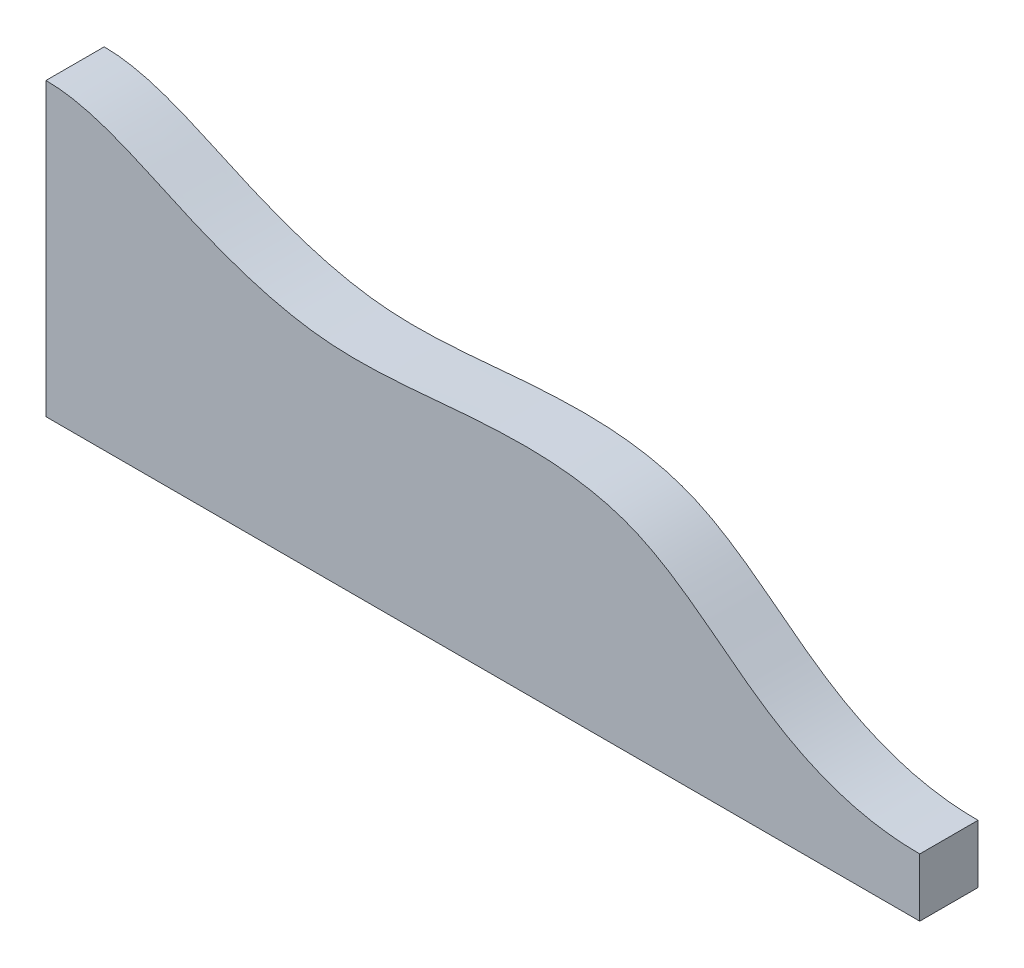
ISO-10303-21;
HEADER;
FILE_DESCRIPTION(('STEP AP214'),'2;1');
FILE_NAME('part.step','',(''),(''),'','','');
FILE_SCHEMA(('AUTOMOTIVE_DESIGN { 1 0 10303 214 1 1 1 1 }'));
ENDSEC;
DATA;
#1=APPLICATION_CONTEXT('core data for automotive mechanical design processes');
#2=APPLICATION_PROTOCOL_DEFINITION('international standard','automotive_design',2000,#1);
#3=PRODUCT_CONTEXT('',#1,'mechanical');
#4=PRODUCT('Part','Part','',(#3));
#5=PRODUCT_RELATED_PRODUCT_CATEGORY('part','',(#4));
#6=PRODUCT_DEFINITION_FORMATION('','',#4);
#7=PRODUCT_DEFINITION_CONTEXT('part definition',#1,'design');
#8=PRODUCT_DEFINITION('design','',#6,#7);
#9=PRODUCT_DEFINITION_SHAPE('','',#8);
#10=(LENGTH_UNIT() NAMED_UNIT(*) SI_UNIT(.MILLI.,.METRE.));
#11=(NAMED_UNIT(*) PLANE_ANGLE_UNIT() SI_UNIT($,.RADIAN.));
#12=(NAMED_UNIT(*) SI_UNIT($,.STERADIAN.) SOLID_ANGLE_UNIT());
#13=UNCERTAINTY_MEASURE_WITH_UNIT(LENGTH_MEASURE(1.E-05),#10,'distance_accuracy_value','');
#14=(GEOMETRIC_REPRESENTATION_CONTEXT(3) GLOBAL_UNCERTAINTY_ASSIGNED_CONTEXT((#13)) GLOBAL_UNIT_ASSIGNED_CONTEXT((#10,
#11,#12)) REPRESENTATION_CONTEXT('',''));
#15=CARTESIAN_POINT('',(0.,0.,0.));
#16=DIRECTION('',(0.,0.,1.));
#17=DIRECTION('',(1.,0.,0.));
#18=AXIS2_PLACEMENT_3D('',#15,#16,#17);
#19=CARTESIAN_POINT('',(300.,0.,10.));
#20=DIRECTION('',(-1.,0.,0.));
#21=DIRECTION('',(0.,0.,1.));
#22=AXIS2_PLACEMENT_3D('',#19,#20,#21);
#23=PLANE('',#22);
#24=DIRECTION('',(0.,0.,-1.));
#25=VECTOR('',#24,1.);
#26=CARTESIAN_POINT('',(300.,20.,431.074487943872));
#27=LINE('',#26,#25);
#28=CARTESIAN_POINT('',(300.,20.,10.0000000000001));
#29=VERTEX_POINT('',#28);
#30=CARTESIAN_POINT('',(300.,20.,-9.99999999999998));
#31=VERTEX_POINT('',#30);
#32=EDGE_CURVE('E96',#29,#31,#27,.T.);
#33=ORIENTED_EDGE('',*,*,#32,.F.);
#34=DIRECTION('',(0.,1.,0.));
#35=VECTOR('',#34,1.);
#36=CARTESIAN_POINT('',(300.,0.,10.));
#37=LINE('',#36,#35);
#38=CARTESIAN_POINT('',(300.,0.,10.));
#39=VERTEX_POINT('',#38);
#40=EDGE_CURVE('E86',#39,#29,#37,.T.);
#41=ORIENTED_EDGE('',*,*,#40,.F.);
#42=DIRECTION('',(0.,0.,-1.));
#43=VECTOR('',#42,1.);
#44=CARTESIAN_POINT('',(300.,0.,10.));
#45=LINE('',#44,#43);
#46=CARTESIAN_POINT('',(300.,0.,-10.));
#47=VERTEX_POINT('',#46);
#48=EDGE_CURVE('E44',#39,#47,#45,.T.);
#49=ORIENTED_EDGE('',*,*,#48,.T.);
#50=DIRECTION('',(0.,1.,0.));
#51=VECTOR('',#50,1.);
#52=CARTESIAN_POINT('',(300.,0.,-10.));
#53=LINE('',#52,#51);
#54=EDGE_CURVE('E93',#47,#31,#53,.T.);
#55=ORIENTED_EDGE('',*,*,#54,.T.);
#56=EDGE_LOOP('',(#33,#41,#49,#55));
#57=FACE_BOUND('',#56,.T.);
#58=ADVANCED_FACE('F35',(#57),#23,.F.);
#59=CARTESIAN_POINT('',(0.,0.,10.));
#60=DIRECTION('',(1.,0.,0.));
#61=DIRECTION('',(0.,0.,-1.));
#62=AXIS2_PLACEMENT_3D('',#59,#60,#61);
#63=PLANE('',#62);
#64=DIRECTION('',(0.,-1.,0.));
#65=VECTOR('',#64,1.);
#66=CARTESIAN_POINT('',(0.,0.,-10.));
#67=LINE('',#66,#65);
#68=CARTESIAN_POINT('',(0.,100.,-9.99999999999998));
#69=VERTEX_POINT('',#68);
#70=CARTESIAN_POINT('',(0.,0.,-10.));
#71=VERTEX_POINT('',#70);
#72=EDGE_CURVE('E95',#69,#71,#67,.T.);
#73=ORIENTED_EDGE('',*,*,#72,.T.);
#74=DIRECTION('',(0.,0.,-1.));
#75=VECTOR('',#74,1.);
#76=CARTESIAN_POINT('',(0.,0.,10.));
#77=LINE('',#76,#75);
#78=CARTESIAN_POINT('',(0.,0.,10.));
#79=VERTEX_POINT('',#78);
#80=EDGE_CURVE('E11',#79,#71,#77,.T.);
#81=ORIENTED_EDGE('',*,*,#80,.F.);
#82=DIRECTION('',(0.,-1.,0.));
#83=VECTOR('',#82,1.);
#84=CARTESIAN_POINT('',(0.,0.,10.));
#85=LINE('',#84,#83);
#86=CARTESIAN_POINT('',(0.,100.,10.));
#87=VERTEX_POINT('',#86);
#88=EDGE_CURVE('E87',#87,#79,#85,.T.);
#89=ORIENTED_EDGE('',*,*,#88,.F.);
#90=DIRECTION('',(0.,0.,-1.));
#91=VECTOR('',#90,1.);
#92=CARTESIAN_POINT('',(0.,100.,10.));
#93=LINE('',#92,#91);
#94=EDGE_CURVE('E52',#87,#69,#93,.T.);
#95=ORIENTED_EDGE('',*,*,#94,.T.);
#96=EDGE_LOOP('',(#73,#81,#89,#95));
#97=FACE_BOUND('',#96,.T.);
#98=ADVANCED_FACE('F37',(#97),#63,.F.);
#99=CARTESIAN_POINT('',(0.,0.,10.));
#100=DIRECTION('',(0.,1.,0.));
#101=DIRECTION('',(0.,0.,1.));
#102=AXIS2_PLACEMENT_3D('',#99,#100,#101);
#103=PLANE('',#102);
#104=DIRECTION('',(1.,0.,0.));
#105=VECTOR('',#104,1.);
#106=CARTESIAN_POINT('',(0.,0.,-10.));
#107=LINE('',#106,#105);
#108=EDGE_CURVE('E65',#71,#47,#107,.T.);
#109=ORIENTED_EDGE('',*,*,#108,.T.);
#110=ORIENTED_EDGE('',*,*,#48,.F.);
#111=DIRECTION('',(1.,0.,0.));
#112=VECTOR('',#111,1.);
#113=CARTESIAN_POINT('',(0.,0.,10.));
#114=LINE('',#113,#112);
#115=EDGE_CURVE('E77',#79,#39,#114,.T.);
#116=ORIENTED_EDGE('',*,*,#115,.F.);
#117=ORIENTED_EDGE('',*,*,#80,.T.);
#118=EDGE_LOOP('',(#109,#110,#116,#117));
#119=FACE_BOUND('',#118,.T.);
#120=ADVANCED_FACE('F79',(#119),#103,.F.);
#121=CARTESIAN_POINT('',(0.,0.,10.));
#122=DIRECTION('',(0.,0.,-1.));
#123=DIRECTION('',(-1.,0.,0.));
#124=AXIS2_PLACEMENT_3D('',#121,#122,#123);
#125=PLANE('',#124);
#126=ORIENTED_EDGE('',*,*,#40,.T.);
#127=CARTESIAN_POINT('',(0.,100.,10.0000000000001));
#128=CARTESIAN_POINT('',(15.9593070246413,100.,10.0000000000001));
#129=CARTESIAN_POINT('',(46.924899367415,83.2007426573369,10.0000000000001));
#130=CARTESIAN_POINT('',(95.2461280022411,66.7232842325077,10.0000000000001));
#131=CARTESIAN_POINT('',(147.465567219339,74.2608244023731,10.0000000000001));
#132=CARTESIAN_POINT('',(204.051794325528,74.1553895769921,10.0000000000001));
#133=CARTESIAN_POINT('',(245.685341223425,33.3438322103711,10.0000000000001));
#134=CARTESIAN_POINT('',(278.806075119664,20.,10.0000000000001));
#135=CARTESIAN_POINT('',(300.,20.,10.0000000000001));
#136=B_SPLINE_CURVE_WITH_KNOTS('',3,(#127,#128,#129,#130,#131,#132,#133,#134,#135),
.UNSPECIFIED.,.F.,.F.,(4,1,1,1,1,1,4),(0.,0.155795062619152,0.313363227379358,0.478453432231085,
0.652442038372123,0.821371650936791,1.),.UNSPECIFIED.);
#137=EDGE_CURVE('E91',#29,#87,#136,.F.);
#138=ORIENTED_EDGE('',*,*,#137,.T.);
#139=ORIENTED_EDGE('',*,*,#88,.T.);
#140=ORIENTED_EDGE('',*,*,#115,.T.);
#141=EDGE_LOOP('',(#126,#138,#139,#140));
#142=FACE_BOUND('',#141,.T.);
#143=ADVANCED_FACE('F90',(#142),#125,.F.);
#144=CARTESIAN_POINT('',(0.,0.,-10.));
#145=DIRECTION('',(0.,0.,-1.));
#146=DIRECTION('',(-1.,0.,0.));
#147=AXIS2_PLACEMENT_3D('',#144,#145,#146);
#148=PLANE('',#147);
#149=CARTESIAN_POINT('',(0.,100.,-9.99999999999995));
#150=CARTESIAN_POINT('',(15.9593070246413,100.,-9.99999999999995));
#151=CARTESIAN_POINT('',(46.924899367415,83.2007426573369,-9.99999999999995));
#152=CARTESIAN_POINT('',(95.2461280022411,66.7232842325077,-9.99999999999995));
#153=CARTESIAN_POINT('',(147.465567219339,74.2608244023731,-9.99999999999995));
#154=CARTESIAN_POINT('',(204.051794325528,74.1553895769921,-9.99999999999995));
#155=CARTESIAN_POINT('',(245.685341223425,33.3438322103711,-9.99999999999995));
#156=CARTESIAN_POINT('',(278.806075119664,20.,-9.99999999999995));
#157=CARTESIAN_POINT('',(300.,20.,-9.99999999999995));
#158=B_SPLINE_CURVE_WITH_KNOTS('',3,(#149,#150,#151,#152,#153,#154,#155,#156,#157),
.UNSPECIFIED.,.F.,.F.,(4,1,1,1,1,1,4),(0.,0.155795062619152,0.313363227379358,0.478453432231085,
0.652442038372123,0.821371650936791,1.),.UNSPECIFIED.);
#159=EDGE_CURVE('E70',#31,#69,#158,.F.);
#160=ORIENTED_EDGE('',*,*,#159,.F.);
#161=ORIENTED_EDGE('',*,*,#54,.F.);
#162=ORIENTED_EDGE('',*,*,#108,.F.);
#163=ORIENTED_EDGE('',*,*,#72,.F.);
#164=EDGE_LOOP('',(#160,#161,#162,#163));
#165=FACE_BOUND('',#164,.T.);
#166=ADVANCED_FACE('F106',(#165),#148,.T.);
#167=CARTESIAN_POINT('',(0.,100.,431.074487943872));
#168=CARTESIAN_POINT('',(15.9593070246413,100.,431.074487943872));
#169=CARTESIAN_POINT('',(46.924899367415,83.2007426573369,431.074487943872));
#170=CARTESIAN_POINT('',(95.2461280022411,66.7232842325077,431.074487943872));
#171=CARTESIAN_POINT('',(147.465567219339,74.2608244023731,431.074487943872));
#172=CARTESIAN_POINT('',(204.051794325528,74.1553895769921,431.074487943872));
#173=CARTESIAN_POINT('',(245.685341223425,33.3438322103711,431.074487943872));
#174=CARTESIAN_POINT('',(278.806075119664,20.,431.074487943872));
#175=CARTESIAN_POINT('',(300.,20.,431.074487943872));
#176=B_SPLINE_CURVE_WITH_KNOTS('',3,(#167,#168,#169,#170,#171,#172,#173,#174,#175),
.UNSPECIFIED.,.F.,.F.,(4,1,1,1,1,1,4),(0.,0.155795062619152,0.313363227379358,0.478453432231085,
0.652442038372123,0.821371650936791,1.),.UNSPECIFIED.);
#177=DIRECTION('',(0.,0.,-1.));
#178=VECTOR('',#177,1.);
#179=SURFACE_OF_LINEAR_EXTRUSION('',#176,#178);
#180=ORIENTED_EDGE('',*,*,#137,.F.);
#181=ORIENTED_EDGE('',*,*,#32,.T.);
#182=ORIENTED_EDGE('',*,*,#159,.T.);
#183=ORIENTED_EDGE('',*,*,#94,.F.);
#184=EDGE_LOOP('',(#180,#181,#182,#183));
#185=FACE_BOUND('',#184,.T.);
#186=ADVANCED_FACE('F127',(#185),#179,.T.);
#187=CLOSED_SHELL('',(#58,#98,#120,#143,#166,#186));
#188=MANIFOLD_SOLID_BREP('B2',#187);
#189=ADVANCED_BREP_SHAPE_REPRESENTATION('',(#18,#188),#14);
#190=SHAPE_DEFINITION_REPRESENTATION(#9,#189);
ENDSEC;
END-ISO-10303-21;
